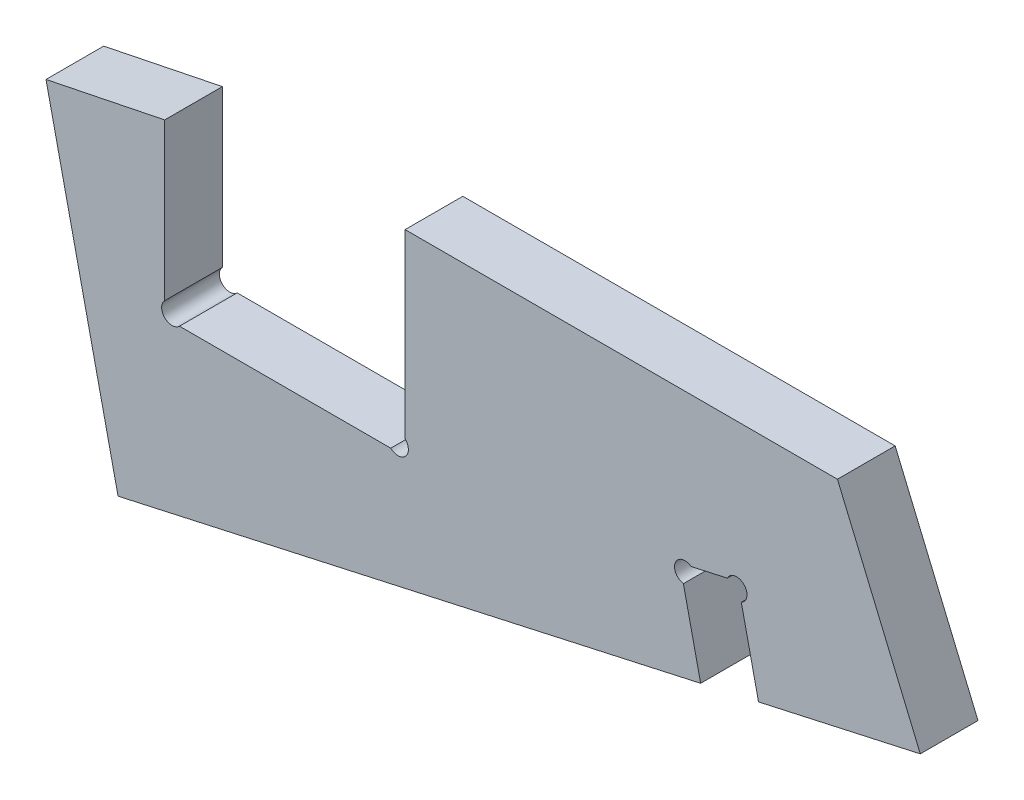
ISO-10303-21;
HEADER;
FILE_DESCRIPTION(('STEP AP214'),'2;1');
FILE_NAME('part.step','',(''),(''),'','','');
FILE_SCHEMA(('AUTOMOTIVE_DESIGN { 1 0 10303 214 1 1 1 1 }'));
ENDSEC;
DATA;
#1=APPLICATION_CONTEXT('core data for automotive mechanical design processes');
#2=APPLICATION_PROTOCOL_DEFINITION('international standard','automotive_design',2000,#1);
#3=PRODUCT_CONTEXT('',#1,'mechanical');
#4=PRODUCT('Part','Part','',(#3));
#5=PRODUCT_RELATED_PRODUCT_CATEGORY('part','',(#4));
#6=PRODUCT_DEFINITION_FORMATION('','',#4);
#7=PRODUCT_DEFINITION_CONTEXT('part definition',#1,'design');
#8=PRODUCT_DEFINITION('design','',#6,#7);
#9=PRODUCT_DEFINITION_SHAPE('','',#8);
#10=(LENGTH_UNIT() NAMED_UNIT(*) SI_UNIT(.MILLI.,.METRE.));
#11=(NAMED_UNIT(*) PLANE_ANGLE_UNIT() SI_UNIT($,.RADIAN.));
#12=(NAMED_UNIT(*) SI_UNIT($,.STERADIAN.) SOLID_ANGLE_UNIT());
#13=UNCERTAINTY_MEASURE_WITH_UNIT(LENGTH_MEASURE(1.E-05),#10,'distance_accuracy_value','');
#14=(GEOMETRIC_REPRESENTATION_CONTEXT(3) GLOBAL_UNCERTAINTY_ASSIGNED_CONTEXT((#13)) GLOBAL_UNIT_ASSIGNED_CONTEXT((#10,
#11,#12)) REPRESENTATION_CONTEXT('',''));
#15=CARTESIAN_POINT('',(0.,0.,0.));
#16=DIRECTION('',(0.,0.,1.));
#17=DIRECTION('',(1.,0.,0.));
#18=AXIS2_PLACEMENT_3D('',#15,#16,#17);
#19=CARTESIAN_POINT('',(163.699716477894,-600.,18.));
#20=DIRECTION('',(-0.216533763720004,0.976275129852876,0.));
#21=DIRECTION('',(-0.976275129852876,-0.216533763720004,0.));
#22=AXIS2_PLACEMENT_3D('',#19,#20,#21);
#23=PLANE('',#22);
#24=DIRECTION('',(0.976275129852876,0.216533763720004,0.));
#25=VECTOR('',#24,1.);
#26=CARTESIAN_POINT('',(163.699716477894,-600.,0.));
#27=LINE('',#26,#25);
#28=CARTESIAN_POINT('',(-86.5408875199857,-655.502325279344,0.));
#29=VERTEX_POINT('',#28);
#30=CARTESIAN_POINT('',(95.1800776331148,-615.197370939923,0.));
#31=VERTEX_POINT('',#30);
#32=EDGE_CURVE('E162',#29,#31,#27,.T.);
#33=ORIENTED_EDGE('',*,*,#32,.T.);
#34=DIRECTION('',(0.,0.,1.));
#35=VECTOR('',#34,1.);
#36=CARTESIAN_POINT('',(95.1800776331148,-615.197370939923,0.));
#37=LINE('',#36,#35);
#38=CARTESIAN_POINT('',(95.1800776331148,-615.197370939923,18.));
#39=VERTEX_POINT('',#38);
#40=EDGE_CURVE('E159',#31,#39,#37,.T.);
#41=ORIENTED_EDGE('',*,*,#40,.T.);
#42=DIRECTION('',(0.976275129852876,0.216533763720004,0.));
#43=VECTOR('',#42,1.);
#44=CARTESIAN_POINT('',(163.699716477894,-600.,18.));
#45=LINE('',#44,#43);
#46=CARTESIAN_POINT('',(-86.5408875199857,-655.502325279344,18.));
#47=VERTEX_POINT('',#46);
#48=EDGE_CURVE('E199',#47,#39,#45,.T.);
#49=ORIENTED_EDGE('',*,*,#48,.F.);
#50=DIRECTION('',(0.,0.,-1.));
#51=VECTOR('',#50,1.);
#52=CARTESIAN_POINT('',(-86.5408875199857,-655.502325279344,18.));
#53=LINE('',#52,#51);
#54=EDGE_CURVE('E41',#47,#29,#53,.T.);
#55=ORIENTED_EDGE('',*,*,#54,.T.);
#56=EDGE_LOOP('',(#33,#41,#49,#55));
#57=FACE_BOUND('',#56,.T.);
#58=ADVANCED_FACE('F33',(#57),#23,.F.);
#59=CARTESIAN_POINT('',(-109.018382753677,-554.159148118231,18.));
#60=DIRECTION('',(0.200389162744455,-0.97971637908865,0.));
#61=DIRECTION('',(0.979716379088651,0.200389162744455,0.));
#62=AXIS2_PLACEMENT_3D('',#59,#60,#61);
#63=PLANE('',#62);
#64=DIRECTION('',(-0.979716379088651,-0.200389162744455,0.));
#65=VECTOR('',#64,1.);
#66=CARTESIAN_POINT('',(-109.018382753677,-554.159148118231,0.));
#67=LINE('',#66,#65);
#68=CARTESIAN_POINT('',(-72.,-546.587484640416,0.));
#69=VERTEX_POINT('',#68);
#70=CARTESIAN_POINT('',(-109.018382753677,-554.159148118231,0.));
#71=VERTEX_POINT('',#70);
#72=EDGE_CURVE('E155',#69,#71,#67,.T.);
#73=ORIENTED_EDGE('',*,*,#72,.T.);
#74=DIRECTION('',(0.,0.,-1.));
#75=VECTOR('',#74,1.);
#76=CARTESIAN_POINT('',(-109.018382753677,-554.159148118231,18.));
#77=LINE('',#76,#75);
#78=CARTESIAN_POINT('',(-109.018382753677,-554.159148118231,18.));
#79=VERTEX_POINT('',#78);
#80=EDGE_CURVE('E11',#79,#71,#77,.T.);
#81=ORIENTED_EDGE('',*,*,#80,.F.);
#82=DIRECTION('',(-0.979716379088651,-0.200389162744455,0.));
#83=VECTOR('',#82,1.);
#84=CARTESIAN_POINT('',(-109.018382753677,-554.159148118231,18.));
#85=LINE('',#84,#83);
#86=CARTESIAN_POINT('',(-72.,-546.587484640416,18.));
#87=VERTEX_POINT('',#86);
#88=EDGE_CURVE('E178',#87,#79,#85,.T.);
#89=ORIENTED_EDGE('',*,*,#88,.F.);
#90=DIRECTION('',(0.,0.,-1.));
#91=VECTOR('',#90,1.);
#92=CARTESIAN_POINT('',(-72.,-546.587484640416,18.));
#93=LINE('',#92,#91);
#94=EDGE_CURVE('E151',#87,#69,#93,.T.);
#95=ORIENTED_EDGE('',*,*,#94,.T.);
#96=EDGE_LOOP('',(#73,#81,#89,#95));
#97=FACE_BOUND('',#96,.T.);
#98=ADVANCED_FACE('F35',(#97),#63,.F.);
#99=CARTESIAN_POINT('',(-86.5408875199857,-655.502325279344,18.));
#100=DIRECTION('',(0.976275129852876,0.216533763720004,0.));
#101=DIRECTION('',(-0.216533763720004,0.976275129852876,0.));
#102=AXIS2_PLACEMENT_3D('',#99,#100,#101);
#103=PLANE('',#102);
#104=DIRECTION('',(0.216533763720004,-0.976275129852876,0.));
#105=VECTOR('',#104,1.);
#106=CARTESIAN_POINT('',(-86.5408875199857,-655.502325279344,0.));
#107=LINE('',#106,#105);
#108=EDGE_CURVE('E158',#71,#29,#107,.T.);
#109=ORIENTED_EDGE('',*,*,#108,.T.);
#110=ORIENTED_EDGE('',*,*,#54,.F.);
#111=DIRECTION('',(0.216533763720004,-0.976275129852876,0.));
#112=VECTOR('',#111,1.);
#113=CARTESIAN_POINT('',(-86.5408875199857,-655.502325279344,18.));
#114=LINE('',#113,#112);
#115=EDGE_CURVE('E104',#79,#47,#114,.T.);
#116=ORIENTED_EDGE('',*,*,#115,.F.);
#117=ORIENTED_EDGE('',*,*,#80,.T.);
#118=EDGE_LOOP('',(#109,#110,#116,#117));
#119=FACE_BOUND('',#118,.T.);
#120=ADVANCED_FACE('F330',(#119),#103,.F.);
#121=CARTESIAN_POINT('',(113.241167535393,-611.191496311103,18.));
#122=VERTEX_POINT('',#121);
#123=CARTESIAN_POINT('',(163.699716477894,-600.,18.));
#124=VERTEX_POINT('',#123);
#125=EDGE_CURVE('E252',#122,#124,#45,.T.);
#126=ORIENTED_EDGE('',*,*,#125,.F.);
#127=DIRECTION('',(0.,0.,1.));
#128=VECTOR('',#127,1.);
#129=CARTESIAN_POINT('',(113.241167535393,-611.191496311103,0.));
#130=LINE('',#129,#128);
#131=CARTESIAN_POINT('',(113.241167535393,-611.191496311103,0.));
#132=VERTEX_POINT('',#131);
#133=EDGE_CURVE('E215',#132,#122,#130,.T.);
#134=ORIENTED_EDGE('',*,*,#133,.F.);
#135=CARTESIAN_POINT('',(163.699716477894,-600.,0.));
#136=VERTEX_POINT('',#135);
#137=EDGE_CURVE('E161',#132,#136,#27,.T.);
#138=ORIENTED_EDGE('',*,*,#137,.T.);
#139=DIRECTION('',(0.,0.,-1.));
#140=VECTOR('',#139,1.);
#141=CARTESIAN_POINT('',(163.699716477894,-600.,18.));
#142=LINE('',#141,#140);
#143=EDGE_CURVE('E191',#124,#136,#142,.T.);
#144=ORIENTED_EDGE('',*,*,#143,.F.);
#145=EDGE_LOOP('',(#126,#134,#138,#144));
#146=FACE_BOUND('',#145,.T.);
#147=ADVANCED_FACE('F310',(#146),#23,.F.);
#148=CARTESIAN_POINT('',(137.858390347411,-538.71758328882,18.));
#149=DIRECTION('',(-0.92142980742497,-0.388544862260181,0.));
#150=DIRECTION('',(0.388544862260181,-0.92142980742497,0.));
#151=AXIS2_PLACEMENT_3D('',#148,#149,#150);
#152=PLANE('',#151);
#153=DIRECTION('',(-0.388544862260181,0.92142980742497,0.));
#154=VECTOR('',#153,1.);
#155=CARTESIAN_POINT('',(137.858390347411,-538.71758328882,0.));
#156=LINE('',#155,#154);
#157=CARTESIAN_POINT('',(137.858390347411,-538.71758328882,0.));
#158=VERTEX_POINT('',#157);
#159=EDGE_CURVE('E165',#136,#158,#156,.T.);
#160=ORIENTED_EDGE('',*,*,#159,.T.);
#161=DIRECTION('',(0.,0.,-1.));
#162=VECTOR('',#161,1.);
#163=CARTESIAN_POINT('',(137.858390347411,-538.71758328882,18.));
#164=LINE('',#163,#162);
#165=CARTESIAN_POINT('',(137.858390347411,-538.71758328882,18.));
#166=VERTEX_POINT('',#165);
#167=EDGE_CURVE('E188',#166,#158,#164,.T.);
#168=ORIENTED_EDGE('',*,*,#167,.F.);
#169=DIRECTION('',(-0.388544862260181,0.92142980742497,0.));
#170=VECTOR('',#169,1.);
#171=CARTESIAN_POINT('',(137.858390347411,-538.71758328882,18.));
#172=LINE('',#171,#170);
#173=EDGE_CURVE('E254',#124,#166,#172,.T.);
#174=ORIENTED_EDGE('',*,*,#173,.F.);
#175=ORIENTED_EDGE('',*,*,#143,.T.);
#176=EDGE_LOOP('',(#160,#168,#174,#175));
#177=FACE_BOUND('',#176,.T.);
#178=ADVANCED_FACE('F333',(#177),#152,.F.);
#179=CARTESIAN_POINT('',(3.,-538.71758328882,18.));
#180=DIRECTION('',(0.,-1.,0.));
#181=DIRECTION('',(0.,0.,-1.));
#182=AXIS2_PLACEMENT_3D('',#179,#180,#181);
#183=PLANE('',#182);
#184=DIRECTION('',(-1.,0.,0.));
#185=VECTOR('',#184,1.);
#186=CARTESIAN_POINT('',(3.,-538.71758328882,0.));
#187=LINE('',#186,#185);
#188=CARTESIAN_POINT('',(3.,-538.71758328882,0.));
#189=VERTEX_POINT('',#188);
#190=EDGE_CURVE('E168',#158,#189,#187,.T.);
#191=ORIENTED_EDGE('',*,*,#190,.T.);
#192=DIRECTION('',(0.,0.,-1.));
#193=VECTOR('',#192,1.);
#194=CARTESIAN_POINT('',(3.,-538.71758328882,18.));
#195=LINE('',#194,#193);
#196=CARTESIAN_POINT('',(3.,-538.71758328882,18.));
#197=VERTEX_POINT('',#196);
#198=EDGE_CURVE('E185',#197,#189,#195,.T.);
#199=ORIENTED_EDGE('',*,*,#198,.F.);
#200=DIRECTION('',(-1.,0.,0.));
#201=VECTOR('',#200,1.);
#202=CARTESIAN_POINT('',(25.3327999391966,-538.71758328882,18.));
#203=LINE('',#202,#201);
#204=EDGE_CURVE('E256',#166,#197,#203,.T.);
#205=ORIENTED_EDGE('',*,*,#204,.F.);
#206=ORIENTED_EDGE('',*,*,#167,.T.);
#207=EDGE_LOOP('',(#191,#199,#205,#206));
#208=FACE_BOUND('',#207,.T.);
#209=ADVANCED_FACE('F338',(#208),#183,.F.);
#210=CARTESIAN_POINT('',(3.,-595.282684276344,18.));
#211=DIRECTION('',(1.,0.,0.));
#212=DIRECTION('',(0.,1.,0.));
#213=AXIS2_PLACEMENT_3D('',#210,#211,#212);
#214=PLANE('',#213);
#215=DIRECTION('',(0.,-1.,0.));
#216=VECTOR('',#215,1.);
#217=CARTESIAN_POINT('',(3.,-595.282684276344,0.));
#218=LINE('',#217,#216);
#219=CARTESIAN_POINT('',(2.99999999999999,-595.282684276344,0.));
#220=VERTEX_POINT('',#219);
#221=EDGE_CURVE('E170',#189,#220,#218,.T.);
#222=ORIENTED_EDGE('',*,*,#221,.T.);
#223=DIRECTION('',(0.,0.,-1.));
#224=VECTOR('',#223,1.);
#225=CARTESIAN_POINT('',(2.99999999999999,-595.282684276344,18.));
#226=LINE('',#225,#224);
#227=CARTESIAN_POINT('',(2.99999999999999,-595.282684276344,18.));
#228=VERTEX_POINT('',#227);
#229=EDGE_CURVE('E182',#228,#220,#226,.T.);
#230=ORIENTED_EDGE('',*,*,#229,.F.);
#231=DIRECTION('',(0.,-1.,0.));
#232=VECTOR('',#231,1.);
#233=CARTESIAN_POINT('',(3.,-595.282684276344,18.));
#234=LINE('',#233,#232);
#235=EDGE_CURVE('E258',#197,#228,#234,.T.);
#236=ORIENTED_EDGE('',*,*,#235,.F.);
#237=ORIENTED_EDGE('',*,*,#198,.T.);
#238=EDGE_LOOP('',(#222,#230,#236,#237));
#239=FACE_BOUND('',#238,.T.);
#240=ADVANCED_FACE('F264',(#239),#214,.F.);
#241=CARTESIAN_POINT('',(0.76410351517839,-597.641342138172,18.));
#242=DIRECTION('',(0.,0.,-1.));
#243=DIRECTION('',(-1.,0.,0.));
#244=AXIS2_PLACEMENT_3D('',#241,#242,#243);
#245=CYLINDRICAL_SURFACE('',#244,3.25);
#246=CARTESIAN_POINT('',(0.76410351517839,-597.641342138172,0.));
#247=DIRECTION('',(0.,0.,-1.));
#248=DIRECTION('',(1.,0.,0.));
#249=AXIS2_PLACEMENT_3D('',#246,#247,#248);
#250=CIRCLE('',#249,3.25);
#251=CARTESIAN_POINT('',(-1.47179296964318,-600.,0.));
#252=VERTEX_POINT('',#251);
#253=EDGE_CURVE('E172',#220,#252,#250,.T.);
#254=ORIENTED_EDGE('',*,*,#253,.T.);
#255=DIRECTION('',(0.,0.,-1.));
#256=VECTOR('',#255,1.);
#257=CARTESIAN_POINT('',(-1.47179296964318,-600.,18.));
#258=LINE('',#257,#256);
#259=CARTESIAN_POINT('',(-1.47179296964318,-600.,18.));
#260=VERTEX_POINT('',#259);
#261=EDGE_CURVE('E146',#260,#252,#258,.T.);
#262=ORIENTED_EDGE('',*,*,#261,.F.);
#263=CARTESIAN_POINT('',(0.76410351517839,-597.641342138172,18.));
#264=DIRECTION('',(0.,0.,-1.));
#265=DIRECTION('',(1.,0.,0.));
#266=AXIS2_PLACEMENT_3D('',#263,#264,#265);
#267=CIRCLE('',#266,3.25);
#268=EDGE_CURVE('E134',#228,#260,#267,.T.);
#269=ORIENTED_EDGE('',*,*,#268,.F.);
#270=ORIENTED_EDGE('',*,*,#229,.T.);
#271=EDGE_LOOP('',(#254,#262,#269,#270));
#272=FACE_BOUND('',#271,.T.);
#273=ADVANCED_FACE('F268',(#272),#245,.F.);
#274=CARTESIAN_POINT('',(-67.3831907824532,-600.,18.));
#275=DIRECTION('',(0.,-1.,0.));
#276=DIRECTION('',(0.,0.,-1.));
#277=AXIS2_PLACEMENT_3D('',#274,#275,#276);
#278=PLANE('',#277);
#279=DIRECTION('',(-1.,0.,0.));
#280=VECTOR('',#279,1.);
#281=CARTESIAN_POINT('',(-67.3831907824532,-600.,0.));
#282=LINE('',#281,#280);
#283=CARTESIAN_POINT('',(-67.3831907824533,-600.,0.));
#284=VERTEX_POINT('',#283);
#285=EDGE_CURVE('E143',#252,#284,#282,.T.);
#286=ORIENTED_EDGE('',*,*,#285,.T.);
#287=DIRECTION('',(0.,0.,-1.));
#288=VECTOR('',#287,1.);
#289=CARTESIAN_POINT('',(-67.3831907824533,-600.,18.));
#290=LINE('',#289,#288);
#291=CARTESIAN_POINT('',(-67.3831907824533,-600.,18.));
#292=VERTEX_POINT('',#291);
#293=EDGE_CURVE('E140',#292,#284,#290,.T.);
#294=ORIENTED_EDGE('',*,*,#293,.F.);
#295=DIRECTION('',(-1.,0.,0.));
#296=VECTOR('',#295,1.);
#297=CARTESIAN_POINT('',(-67.3831907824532,-600.,18.));
#298=LINE('',#297,#296);
#299=EDGE_CURVE('E126',#260,#292,#298,.T.);
#300=ORIENTED_EDGE('',*,*,#299,.F.);
#301=ORIENTED_EDGE('',*,*,#261,.T.);
#302=EDGE_LOOP('',(#286,#294,#300,#301));
#303=FACE_BOUND('',#302,.T.);
#304=ADVANCED_FACE('F141',(#303),#278,.F.);
#305=CARTESIAN_POINT('',(-69.6915953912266,-597.712256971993,18.));
#306=DIRECTION('',(0.,0.,-1.));
#307=DIRECTION('',(-1.,0.,0.));
#308=AXIS2_PLACEMENT_3D('',#305,#306,#307);
#309=CYLINDRICAL_SURFACE('',#308,3.24999999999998);
#310=CARTESIAN_POINT('',(-69.6915953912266,-597.712256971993,0.));
#311=DIRECTION('',(0.,0.,-1.));
#312=DIRECTION('',(1.,0.,0.));
#313=AXIS2_PLACEMENT_3D('',#310,#311,#312);
#314=CIRCLE('',#313,3.24999999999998);
#315=CARTESIAN_POINT('',(-71.9999999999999,-595.424513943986,0.));
#316=VERTEX_POINT('',#315);
#317=EDGE_CURVE('E175',#284,#316,#314,.T.);
#318=ORIENTED_EDGE('',*,*,#317,.T.);
#319=DIRECTION('',(0.,0.,-1.));
#320=VECTOR('',#319,1.);
#321=CARTESIAN_POINT('',(-71.9999999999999,-595.424513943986,18.));
#322=LINE('',#321,#320);
#323=CARTESIAN_POINT('',(-71.9999999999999,-595.424513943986,18.));
#324=VERTEX_POINT('',#323);
#325=EDGE_CURVE('E147',#324,#316,#322,.T.);
#326=ORIENTED_EDGE('',*,*,#325,.F.);
#327=CARTESIAN_POINT('',(-69.6915953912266,-597.712256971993,18.));
#328=DIRECTION('',(0.,0.,-1.));
#329=DIRECTION('',(1.,0.,0.));
#330=AXIS2_PLACEMENT_3D('',#327,#328,#329);
#331=CIRCLE('',#330,3.24999999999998);
#332=EDGE_CURVE('E131',#292,#324,#331,.T.);
#333=ORIENTED_EDGE('',*,*,#332,.F.);
#334=ORIENTED_EDGE('',*,*,#293,.T.);
#335=EDGE_LOOP('',(#318,#326,#333,#334));
#336=FACE_BOUND('',#335,.T.);
#337=ADVANCED_FACE('F149',(#336),#309,.F.);
#338=CARTESIAN_POINT('',(-72.,-546.587484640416,18.));
#339=DIRECTION('',(-1.,0.,0.));
#340=DIRECTION('',(0.,-1.,0.));
#341=AXIS2_PLACEMENT_3D('',#338,#339,#340);
#342=PLANE('',#341);
#343=DIRECTION('',(0.,1.,0.));
#344=VECTOR('',#343,1.);
#345=CARTESIAN_POINT('',(-72.,-546.587484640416,0.));
#346=LINE('',#345,#344);
#347=EDGE_CURVE('E96',#316,#69,#346,.T.);
#348=ORIENTED_EDGE('',*,*,#347,.T.);
#349=ORIENTED_EDGE('',*,*,#94,.F.);
#350=DIRECTION('',(0.,1.,0.));
#351=VECTOR('',#350,1.);
#352=CARTESIAN_POINT('',(-72.,-546.587484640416,18.));
#353=LINE('',#352,#351);
#354=EDGE_CURVE('E57',#324,#87,#353,.T.);
#355=ORIENTED_EDGE('',*,*,#354,.F.);
#356=ORIENTED_EDGE('',*,*,#325,.T.);
#357=EDGE_LOOP('',(#348,#349,#355,#356));
#358=FACE_BOUND('',#357,.T.);
#359=ADVANCED_FACE('F269',(#358),#342,.F.);
#360=CARTESIAN_POINT('',(-69.6915953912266,-597.712256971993,18.));
#361=DIRECTION('',(0.,0.,1.));
#362=DIRECTION('',(1.,0.,0.));
#363=AXIS2_PLACEMENT_3D('',#360,#361,#362);
#364=PLANE('',#363);
#365=DIRECTION('',(0.216533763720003,-0.976275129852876,0.));
#366=VECTOR('',#365,1.);
#367=CARTESIAN_POINT('',(89.8037860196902,-590.957549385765,18.));
#368=LINE('',#367,#366);
#369=CARTESIAN_POINT('',(89.8037860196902,-590.957549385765,18.));
#370=VERTEX_POINT('',#369);
#371=EDGE_CURVE('E236',#370,#39,#368,.T.);
#372=ORIENTED_EDGE('',*,*,#371,.F.);
#373=CARTESIAN_POINT('',(90.3010264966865,-587.74581279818,18.));
#374=DIRECTION('',(0.,0.,1.));
#375=DIRECTION('',(1.,0.,0.));
#376=AXIS2_PLACEMENT_3D('',#373,#374,#375);
#377=CIRCLE('',#376,3.24999999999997);
#378=CARTESIAN_POINT('',(92.2221295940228,-585.124388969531,18.));
#379=VERTEX_POINT('',#378);
#380=EDGE_CURVE('E233',#379,#370,#377,.T.);
#381=ORIENTED_EDGE('',*,*,#380,.F.);
#382=DIRECTION('',(-0.976275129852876,-0.216533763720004,0.));
#383=VECTOR('',#382,1.);
#384=CARTESIAN_POINT('',(103.468336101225,-582.630027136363,18.));
#385=LINE('',#384,#383);
#386=CARTESIAN_POINT('',(103.468336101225,-582.630027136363,18.));
#387=VERTEX_POINT('',#386);
#388=EDGE_CURVE('E230',#387,#379,#385,.T.);
#389=ORIENTED_EDGE('',*,*,#388,.F.);
#390=CARTESIAN_POINT('',(106.388659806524,-584.056284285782,18.));
#391=DIRECTION('',(0.,0.,1.));
#392=DIRECTION('',(1.,0.,0.));
#393=AXIS2_PLACEMENT_3D('',#390,#391,#392);
#394=CIRCLE('',#393,3.24999999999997);
#395=CARTESIAN_POINT('',(107.864875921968,-586.951674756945,18.));
#396=VERTEX_POINT('',#395);
#397=EDGE_CURVE('E227',#396,#387,#394,.T.);
#398=ORIENTED_EDGE('',*,*,#397,.F.);
#399=DIRECTION('',(-0.216533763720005,0.976275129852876,0.));
#400=VECTOR('',#399,1.);
#401=CARTESIAN_POINT('',(113.241167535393,-611.191496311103,18.));
#402=LINE('',#401,#400);
#403=EDGE_CURVE('E224',#122,#396,#402,.T.);
#404=ORIENTED_EDGE('',*,*,#403,.F.);
#405=ORIENTED_EDGE('',*,*,#125,.T.);
#406=ORIENTED_EDGE('',*,*,#173,.T.);
#407=ORIENTED_EDGE('',*,*,#204,.T.);
#408=ORIENTED_EDGE('',*,*,#235,.T.);
#409=ORIENTED_EDGE('',*,*,#268,.T.);
#410=ORIENTED_EDGE('',*,*,#299,.T.);
#411=ORIENTED_EDGE('',*,*,#332,.T.);
#412=ORIENTED_EDGE('',*,*,#354,.T.);
#413=ORIENTED_EDGE('',*,*,#88,.T.);
#414=ORIENTED_EDGE('',*,*,#115,.T.);
#415=ORIENTED_EDGE('',*,*,#48,.T.);
#416=EDGE_LOOP('',(#372,#381,#389,#398,#404,#405,#406,#407,#408,#409,#410,#411,#412,#413,#414,#415));
#417=FACE_BOUND('',#416,.T.);
#418=ADVANCED_FACE('F129',(#417),#364,.T.);
#419=CARTESIAN_POINT('',(-69.6915953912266,-597.712256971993,0.));
#420=DIRECTION('',(0.,0.,1.));
#421=DIRECTION('',(1.,0.,0.));
#422=AXIS2_PLACEMENT_3D('',#419,#420,#421);
#423=PLANE('',#422);
#424=CARTESIAN_POINT('',(90.3010264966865,-587.74581279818,0.));
#425=DIRECTION('',(0.,0.,1.));
#426=DIRECTION('',(1.,0.,0.));
#427=AXIS2_PLACEMENT_3D('',#424,#425,#426);
#428=CIRCLE('',#427,3.24999999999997);
#429=CARTESIAN_POINT('',(92.2221295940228,-585.124388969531,0.));
#430=VERTEX_POINT('',#429);
#431=CARTESIAN_POINT('',(89.8037860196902,-590.957549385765,0.));
#432=VERTEX_POINT('',#431);
#433=EDGE_CURVE('E210',#430,#432,#428,.T.);
#434=ORIENTED_EDGE('',*,*,#433,.T.);
#435=DIRECTION('',(0.216533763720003,-0.976275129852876,0.));
#436=VECTOR('',#435,1.);
#437=CARTESIAN_POINT('',(89.8037860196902,-590.957549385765,0.));
#438=LINE('',#437,#436);
#439=EDGE_CURVE('E206',#432,#31,#438,.T.);
#440=ORIENTED_EDGE('',*,*,#439,.T.);
#441=ORIENTED_EDGE('',*,*,#32,.F.);
#442=ORIENTED_EDGE('',*,*,#108,.F.);
#443=ORIENTED_EDGE('',*,*,#72,.F.);
#444=ORIENTED_EDGE('',*,*,#347,.F.);
#445=ORIENTED_EDGE('',*,*,#317,.F.);
#446=ORIENTED_EDGE('',*,*,#285,.F.);
#447=ORIENTED_EDGE('',*,*,#253,.F.);
#448=ORIENTED_EDGE('',*,*,#221,.F.);
#449=ORIENTED_EDGE('',*,*,#190,.F.);
#450=ORIENTED_EDGE('',*,*,#159,.F.);
#451=ORIENTED_EDGE('',*,*,#137,.F.);
#452=DIRECTION('',(-0.216533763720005,0.976275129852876,0.));
#453=VECTOR('',#452,1.);
#454=CARTESIAN_POINT('',(113.241167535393,-611.191496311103,0.));
#455=LINE('',#454,#453);
#456=CARTESIAN_POINT('',(107.864875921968,-586.951674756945,0.));
#457=VERTEX_POINT('',#456);
#458=EDGE_CURVE('E239',#132,#457,#455,.T.);
#459=ORIENTED_EDGE('',*,*,#458,.T.);
#460=CARTESIAN_POINT('',(106.388659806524,-584.056284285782,0.));
#461=DIRECTION('',(0.,0.,1.));
#462=DIRECTION('',(1.,0.,0.));
#463=AXIS2_PLACEMENT_3D('',#460,#461,#462);
#464=CIRCLE('',#463,3.24999999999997);
#465=CARTESIAN_POINT('',(103.468336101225,-582.630027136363,0.));
#466=VERTEX_POINT('',#465);
#467=EDGE_CURVE('E48',#457,#466,#464,.T.);
#468=ORIENTED_EDGE('',*,*,#467,.T.);
#469=DIRECTION('',(-0.976275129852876,-0.216533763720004,0.));
#470=VECTOR('',#469,1.);
#471=CARTESIAN_POINT('',(103.468336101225,-582.630027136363,0.));
#472=LINE('',#471,#470);
#473=EDGE_CURVE('E220',#466,#430,#472,.T.);
#474=ORIENTED_EDGE('',*,*,#473,.T.);
#475=EDGE_LOOP('',(#434,#440,#441,#442,#443,#444,#445,#446,#447,#448,#449,#450,#451,#459,#468,#474));
#476=FACE_BOUND('',#475,.T.);
#477=ADVANCED_FACE('F203',(#476),#423,.F.);
#478=CARTESIAN_POINT('',(89.8037860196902,-590.957549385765,0.));
#479=DIRECTION('',(-0.976275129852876,-0.216533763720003,0.));
#480=DIRECTION('',(0.216533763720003,-0.976275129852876,0.));
#481=AXIS2_PLACEMENT_3D('',#478,#479,#480);
#482=PLANE('',#481);
#483=ORIENTED_EDGE('',*,*,#371,.T.);
#484=ORIENTED_EDGE('',*,*,#40,.F.);
#485=ORIENTED_EDGE('',*,*,#439,.F.);
#486=DIRECTION('',(0.,0.,1.));
#487=VECTOR('',#486,1.);
#488=CARTESIAN_POINT('',(89.8037860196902,-590.957549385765,0.));
#489=LINE('',#488,#487);
#490=EDGE_CURVE('E241',#432,#370,#489,.T.);
#491=ORIENTED_EDGE('',*,*,#490,.T.);
#492=EDGE_LOOP('',(#483,#484,#485,#491));
#493=FACE_BOUND('',#492,.T.);
#494=ADVANCED_FACE('F317',(#493),#482,.F.);
#495=CARTESIAN_POINT('',(90.3010264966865,-587.74581279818,0.));
#496=DIRECTION('',(0.,0.,1.));
#497=DIRECTION('',(1.,0.,0.));
#498=AXIS2_PLACEMENT_3D('',#495,#496,#497);
#499=CYLINDRICAL_SURFACE('',#498,3.24999999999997);
#500=ORIENTED_EDGE('',*,*,#380,.T.);
#501=ORIENTED_EDGE('',*,*,#490,.F.);
#502=ORIENTED_EDGE('',*,*,#433,.F.);
#503=DIRECTION('',(0.,0.,1.));
#504=VECTOR('',#503,1.);
#505=CARTESIAN_POINT('',(92.2221295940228,-585.124388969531,0.));
#506=LINE('',#505,#504);
#507=EDGE_CURVE('E243',#430,#379,#506,.T.);
#508=ORIENTED_EDGE('',*,*,#507,.T.);
#509=EDGE_LOOP('',(#500,#501,#502,#508));
#510=FACE_BOUND('',#509,.T.);
#511=ADVANCED_FACE('F315',(#510),#499,.F.);
#512=CARTESIAN_POINT('',(103.468336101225,-582.630027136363,0.));
#513=DIRECTION('',(-0.216533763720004,0.976275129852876,0.));
#514=DIRECTION('',(-0.976275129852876,-0.216533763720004,0.));
#515=AXIS2_PLACEMENT_3D('',#512,#513,#514);
#516=PLANE('',#515);
#517=ORIENTED_EDGE('',*,*,#388,.T.);
#518=ORIENTED_EDGE('',*,*,#507,.F.);
#519=ORIENTED_EDGE('',*,*,#473,.F.);
#520=DIRECTION('',(0.,0.,1.));
#521=VECTOR('',#520,1.);
#522=CARTESIAN_POINT('',(103.468336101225,-582.630027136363,0.));
#523=LINE('',#522,#521);
#524=EDGE_CURVE('E246',#466,#387,#523,.T.);
#525=ORIENTED_EDGE('',*,*,#524,.T.);
#526=EDGE_LOOP('',(#517,#518,#519,#525));
#527=FACE_BOUND('',#526,.T.);
#528=ADVANCED_FACE('F298',(#527),#516,.F.);
#529=CARTESIAN_POINT('',(106.388659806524,-584.056284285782,0.));
#530=DIRECTION('',(0.,0.,1.));
#531=DIRECTION('',(1.,0.,0.));
#532=AXIS2_PLACEMENT_3D('',#529,#530,#531);
#533=CYLINDRICAL_SURFACE('',#532,3.24999999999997);
#534=ORIENTED_EDGE('',*,*,#397,.T.);
#535=ORIENTED_EDGE('',*,*,#524,.F.);
#536=ORIENTED_EDGE('',*,*,#467,.F.);
#537=DIRECTION('',(0.,0.,1.));
#538=VECTOR('',#537,1.);
#539=CARTESIAN_POINT('',(107.864875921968,-586.951674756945,0.));
#540=LINE('',#539,#538);
#541=EDGE_CURVE('E218',#457,#396,#540,.T.);
#542=ORIENTED_EDGE('',*,*,#541,.T.);
#543=EDGE_LOOP('',(#534,#535,#536,#542));
#544=FACE_BOUND('',#543,.T.);
#545=ADVANCED_FACE('F294',(#544),#533,.F.);
#546=CARTESIAN_POINT('',(113.241167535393,-611.191496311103,0.));
#547=DIRECTION('',(0.976275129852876,0.216533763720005,0.));
#548=DIRECTION('',(-0.216533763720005,0.976275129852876,0.));
#549=AXIS2_PLACEMENT_3D('',#546,#547,#548);
#550=PLANE('',#549);
#551=ORIENTED_EDGE('',*,*,#403,.T.);
#552=ORIENTED_EDGE('',*,*,#541,.F.);
#553=ORIENTED_EDGE('',*,*,#458,.F.);
#554=ORIENTED_EDGE('',*,*,#133,.T.);
#555=EDGE_LOOP('',(#551,#552,#553,#554));
#556=FACE_BOUND('',#555,.T.);
#557=ADVANCED_FACE('F306',(#556),#550,.F.);
#558=CLOSED_SHELL('',(#58,#98,#120,#147,#178,#209,#240,#273,#304,#337,#359,#418,#477,#494,#511,
#528,#545,#557));
#559=MANIFOLD_SOLID_BREP('B2',#558);
#560=ADVANCED_BREP_SHAPE_REPRESENTATION('',(#18,#559),#14);
#561=SHAPE_DEFINITION_REPRESENTATION(#9,#560);
ENDSEC;
END-ISO-10303-21;
